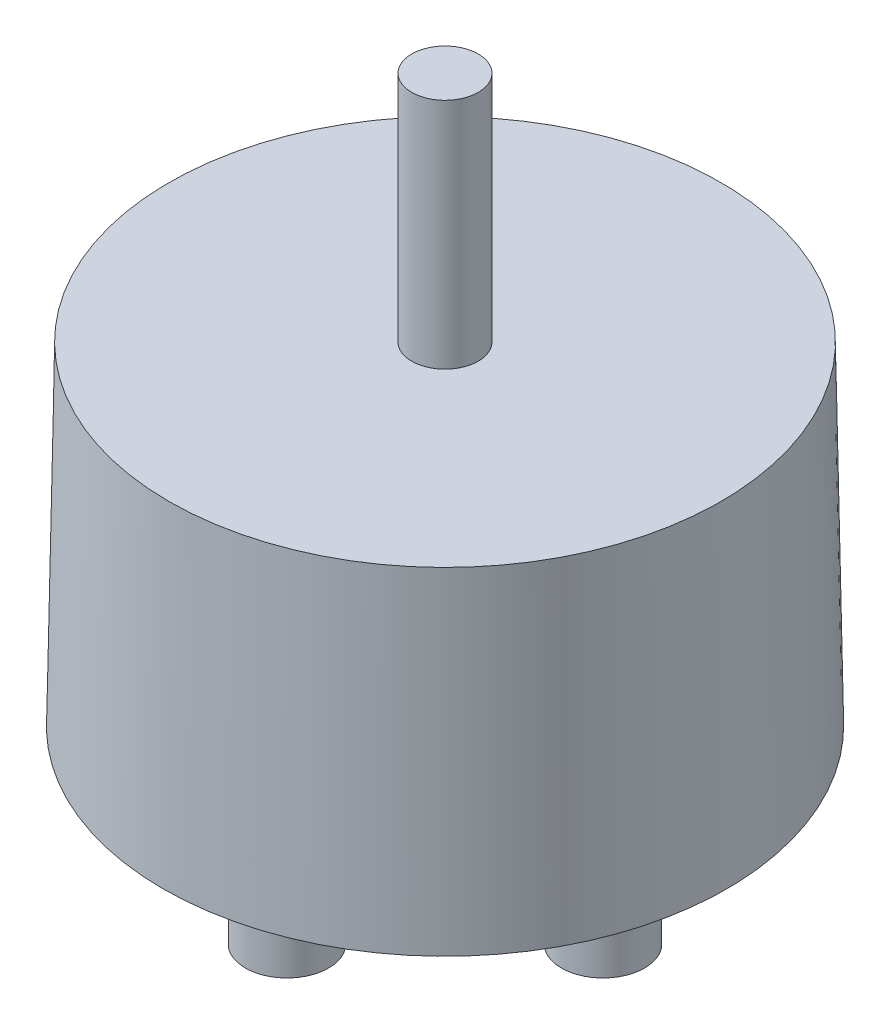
from build123d import *

# Parameters (mm, degrees)
SKETCH1_R           = 1.5
BOSS_EXTRUDE1_DEPTH = 6.6
SKETCH2_R           = 16.95
BOSS_EXTRUDE2_DEPTH = 20
BOSS_EXTRUDE2_TAPER = 1
SKETCH3_R           = 2
BOSS_EXTRUDE3_DEPTH = 14


with BuildPart() as part:
    # Sketch1 → Boss-Extrude1 (new body)
    with BuildSketch(Plane(origin=(0, 0, 0), x_dir=(1, 0, 0), z_dir=(0, 1, 0))):
        with BuildLine():
            ThreePointArc((-7.789473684, 1.823211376), (-12, 0), (-7.789473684, -1.823211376))
            ThreePointArc((-7.789473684, -1.823211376), (-3.570689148, -3.570689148), (-1.823211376, -7.789473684))
            ThreePointArc((-1.823211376, -7.789473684), (0, -12), (1.823211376, -7.789473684))
            ThreePointArc((1.823211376, -7.789473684), (3.570689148, -3.570689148), (7.789473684, -1.823211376))
            ThreePointArc((7.789473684, -1.823211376), (12, 0), (7.789473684, 1.823211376))
            ThreePointArc((7.789473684, 1.823211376), (3.570689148, 3.570689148), (1.823211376, 7.789473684))
            ThreePointArc((1.823211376, 7.789473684), (0, 12), (-1.823211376, 7.789473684))
            ThreePointArc((-1.823211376, 7.789473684), (-3.570689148, 3.570689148), (-7.789473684, 1.823211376))
        make_face()
        with Locations(Location((0, 9.5, 0), (0, 0, 270))):
            Circle(SKETCH1_R, mode=Mode.SUBTRACT)
        with Locations(Location((9.5, 0, 0), (0, 0, 270))):
            Circle(SKETCH1_R, mode=Mode.SUBTRACT)
        with Locations(Location((0, -9.5, 0), (0, 0, 270))):
            Circle(SKETCH1_R, mode=Mode.SUBTRACT)
        with Locations(Location((-9.5, 0, 0), (0, 0, 270))):
            Circle(SKETCH1_R, mode=Mode.SUBTRACT)
    extrude(amount=BOSS_EXTRUDE1_DEPTH)

    # Sketch2 → Boss-Extrude2 (add)
    with BuildSketch(Plane(origin=(0, 6.6, 0), x_dir=(1, 0, 0), z_dir=(0, 1, 0))):
        Circle(SKETCH2_R)
    extrude(amount=BOSS_EXTRUDE2_DEPTH, taper=BOSS_EXTRUDE2_TAPER)

    # Sketch3 → Boss-Extrude3 (add)
    with BuildSketch(Plane(origin=(0, 26.6, 0), x_dir=(1, 0, 0), z_dir=(0, 1, 0))):
        with Locations(Location((0, 0, 0), (0, 0, 270))):
            Circle(SKETCH3_R)
    extrude(amount=BOSS_EXTRUDE3_DEPTH)


solid = part.part
